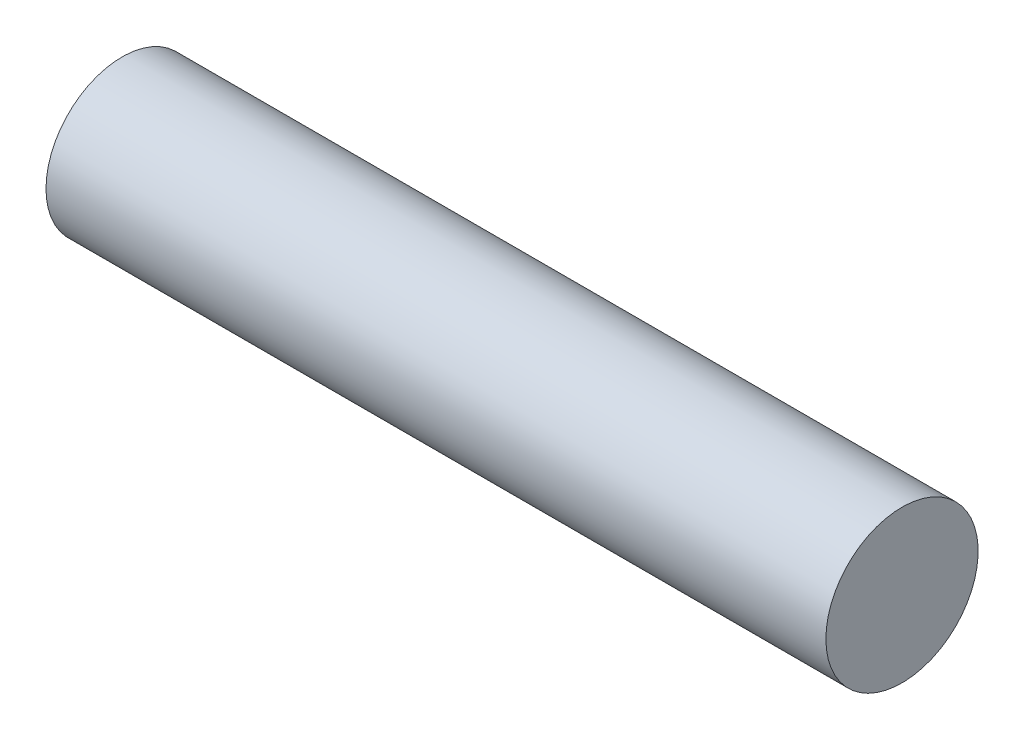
from build123d import *

# Parameters (mm, degrees)
SKETCH1_R           = 2.05
BOSS_EXTRUDE1_DEPTH = 21


with BuildPart() as part:
    # Sketch1 → Boss-Extrude1 (new body)
    with BuildSketch(Plane(origin=(0, 0, 0), x_dir=(0, 0, -1), z_dir=(1, 0, 0))):
        with Locations(Location((0, 0, 0), (0, 0, 180))):
            Circle(SKETCH1_R)
    extrude(amount=BOSS_EXTRUDE1_DEPTH)


solid = part.part
